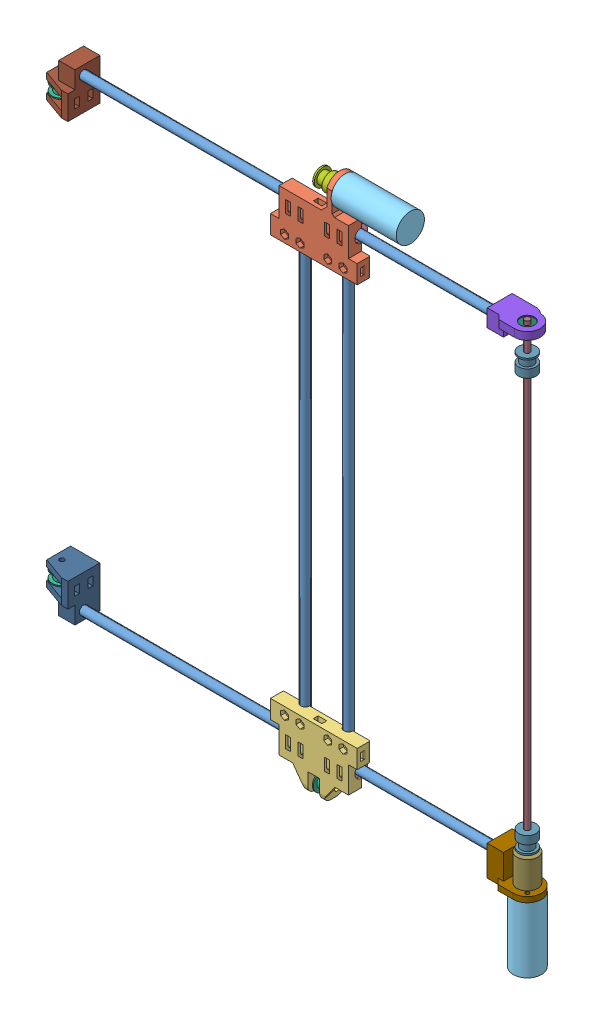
SolidWorks assembly Robot cartesiano.SLDASM, configuration Predeterminado (file format 13000). Lengths in mm.
Overall size (456.38 554.33 36.77).
25 component instances, 15 part files, 58 mates.
Components (placement in the parent):
- Varilla lisa 8x400mm-2: Varilla lisa 8x400mm.SLDPRT [Predeterminado] at (-188.4214 -67.4179 400) x (0 1 0) z (1 0 0) size (8 8 400)
- Varilla lisa 8x400mm-3: Varilla lisa 8x400mm.SLDPRT [Predeterminado] at (-188.4214 -494.7179 400) x (0 1 0) z (1 0 0) size (8 8 400)
- Varilla lisa 8x400mm-4: Varilla lisa 8x400mm.SLDPRT [Predeterminado] at (25.8459 -81.0679 400) x (1 0 0) z (0 -1 0) size (8 8 400)
- Varilla lisa 8x400mm-5: Varilla lisa 8x400mm.SLDPRT [Predeterminado] at (65.6459 -81.0679 400) x (1 0 0) z (0 -1 0) size (8 8 400)
- Carro x A-1: Carro x A.SLDPRT [Predeterminado] at (77.7459 -67.4179 400) x (0 1 0) z (-1 0 0) size (71.3 25 80)
- Carro x B-2: Carro x B.SLDPRT [Predeterminado] at (13.7459 -494.7179 400) x (0 -1 0) z (1 0 0) size (59.3 18 80)
- Lm8uu-1: Lm8uu.SLDPRT [Predeterminado] at (39.8459 -67.4179 400) x (0 0 1) z (-1 0 0) size (15 15 24)
- Lm8uu-2: Lm8uu.SLDPRT [Predeterminado] at (51.7459 -67.4179 400) x (0 0 -1) z (1 0 0) size (15 15 24)
- Lm8uu-3: Lm8uu.SLDPRT [Predeterminado] at (15.7459 -494.7179 400) x (0 0 -1) z (1 0 0) size (15 15 24)
- Lm8uu-4: Lm8uu.SLDPRT [Predeterminado] at (51.7459 -494.7179 400) x (0 0 -1) z (1 0 0) size (15 15 24)
- Motor-1: Motor.SLDPRT [Predeterminado] at (62.7459 -38.7679 400) x (0 -0.707107 -0.707107) z (1 0 0) size (26 26 75)
- Polea gt2 general 12mm B4-1: Polea gt2 general 12mm B4.SLDPRT [Predeterminado] at (49.9959 -520.3679 400) x (0 0 -1) z (-1 0 0) size (18 18 8.5)
- Polea gt2 20t motor eje x-1: Polea gt2 20t motor eje x.SLDPRT [Predeterminado] at (40.7459 -38.7679 400) x (0 0 -1) z (1 0 0) size (16 16 16)
- Fijacion del marco con soporte para balero 625-1: Fijacion del marco con soporte para balero 625.SLDPRT [Predeterminado] at (211.5786 -67.4179 400) x (0 -1 0) z (-1 0 0) size (16 27 41)
- Fijacion del marco con soporte para motor-1: Fijacion del marco con soporte para motor.SLDPRT [Predeterminado] at (211.5786 -494.7179 400) x (0 -1 0) z (-1 0 0) size (28 28 42)
- Motor-2: Motor.SLDPRT [Predeterminado] at (230.5786 -514.7179 400) x (-0.707107 0 -0.707107) z (0 -1 0) size (26 26 75)
- Fijacion del marco con soporte para polea A-1: Fijacion del marco con soporte para polea A.SLDPRT [Predeterminado] at (-188.4214 -494.7179 400) x (0 1 0) z (1 0 0) size (38.15 29.5 27)
- Fijacion del marco con soporte para polea B-1: Fijacion del marco con soporte para polea B.SLDPRT [Predeterminado] at (-198.4214 -67.4179 400) x (0 -1 0) z (-1 0 0) size (38.15 29.5 27)
- Polea gt2 general 12mm B4-2: Polea gt2 general 12mm B4.SLDPRT [Predeterminado] at (-198.4214 -82.3179 400) x (1 0 0) z (0 -1 0) size (18 18 8.5)
- Polea gt2 general 12mm B4-3: Polea gt2 general 12mm B4.SLDPRT [Predeterminado] at (-198.4214 -471.3179 400) x (1 0 0) z (0 -1 0) size (18 18 8.5)
- Cople 4mm a 5mm flexible-1: Cople 4mm a 5mm flexible.SLDPRT [Predeterminado] at (230.5786 -507.7179 400) x (0.999563 0 0.02957) z (0 1 0) size (19 19 25)
- Varilla lisa 5x440mm-1: Varilla lisa 5x440mm.SLDPRT [Predeterminado] at (230.5786 -57.7179 400) x (0.999563 0 0.02957) z (0 -1 0) size (5 5 440)
- Polea gt2 20t motor eje y-1: Polea gt2 20t motor eje y.SLDPRT [Predeterminado] at (230.5786 -480.5679 400) x (0.326284 0 -0.945272) z (0 1 0) size (16 16 16)
- Polea gt2 20t motor eje y-2: Polea gt2 20t motor eje y.SLDPRT [Predeterminado] at (230.5786 -83.5679 400) x (1 0 0) z (0 -1 0) size (16 16 16)
- Balero 625-1: Balero 625.SLDPRT [Predeterminado] at (230.5786 -61.4179 400) x (1 0 0) z (0 -1 0) size (16 16 5)
Mates (geometry in assembly coordinates):
- Concéntrica1: concentric aligned: cylinder of Varilla lisa 8x400mm-3 through (211.5786 -494.7179 400) axis (-1 0 0) radius 4; cylinder of Carro x B-2 through (51.6459 -494.7179 400) axis (-1 0 0) radius 6.15
- Concéntrica2: concentric anti-aligned: cylinder of Varilla lisa 8x400mm-5 through (65.6459 -481.0679 400) axis (0 1 0) radius 4; cylinder of Carro x B-2 through (65.6459 -467.0679 400) axis (0 -1 0) radius 4.1
- Coincidente1: coincident anti-aligned: plane of Varilla lisa 8x400mm-5 through (65.6459 -481.0679 400) normal (0 -1 0); plane of Carro x B-2 through (77.7459 -481.0679 400) normal (0 1 0)
- Concéntrica3: concentric anti-aligned: cylinder of Varilla lisa 8x400mm-4 through (25.8459 -481.0679 400) axis (0 1 0) radius 4; cylinder of Carro x B-2 through (25.8459 -467.0679 400) axis (0 -1 0) radius 4.1
- Coincidente2: coincident anti-aligned: plane of Varilla lisa 8x400mm-4 through (25.8459 -481.0679 400) normal (0 -1 0); plane of Carro x B-2 through (77.7459 -481.0679 400) normal (0 1 0)
- Coincidente3: coincident anti-aligned: plane of Varilla lisa 8x400mm-5 through (65.6459 -81.0679 400) normal (0 1 0); plane of Carro x A-1 through (13.7459 -81.0679 400) normal (0 -1 0)
- Concéntrica4: concentric aligned: cylinder of Varilla lisa 8x400mm-5 through (65.6459 -481.0679 400) axis (0 1 0) radius 4; cylinder of Carro x A-1 through (65.6459 -97.0679 400) axis (0 1 0) radius 4.1
- Concéntrica5: concentric aligned: cylinder of Varilla lisa 8x400mm-4 through (25.8459 -481.0679 400) axis (0 1 0) radius 4; cylinder of Carro x A-1 through (25.8459 -97.0679 400) axis (0 1 0) radius 4.1
- Concéntrica6: concentric anti-aligned: cylinder of Varilla lisa 8x400mm-2 through (211.5786 -67.4179 400) axis (-1 0 0) radius 4; cylinder of Carro x A-1 through (39.8459 -67.4179 400) axis (1 0 0) radius 6.15
- Coincidente4: coincident aligned: plane of Varilla lisa 8x400mm-2 through (211.5786 -67.4179 400) normal (1 0 0); plane of Varilla lisa 8x400mm-3 through (211.5786 -494.7179 400) normal (1 0 0)
- Paralelo1: parallel aligned: plane of Carro x A-1 through (13.7459 -81.0679 412) normal (0 0 1)
- Coincidente5: coincident anti-aligned: plane of Carro x A-1 through (39.8459 -67.4179 400) normal (-1 0 0); plane of Lm8uu-1 through (39.8459 -67.4179 400) normal (1 0 0)
- Concéntrica7: concentric aligned: cylinder of Carro x A-1 through (13.7459 -67.4179 400) axis (1 0 0) radius 7.65; cylinder of Lm8uu-1 through (15.8459 -67.4179 400) axis (1 0 0) radius 7.5
- Coincidente6: coincident aligned: circle of Carro x A-1; plane of Lm8uu-2 through (75.7459 -67.4179 400) normal (1 0 0)
- Concéntrica8: concentric anti-aligned: cylinder of Carro x A-1 through (13.7459 -67.4179 400) axis (1 0 0) radius 7.65; cylinder of Lm8uu-2 through (75.7459 -67.4179 400) axis (-1 0 0) radius 7.5
- Coincidente7: coincident anti-aligned: plane of Carro x B-2 through (15.7459 -494.7179 400) normal (1 0 0); plane of Lm8uu-3 through (15.7459 -494.7179 400) normal (-1 0 0)
- Concéntrica9: concentric aligned: cylinder of Carro x B-2 through (77.7459 -494.7179 400) axis (-1 0 0) radius 7.65; cylinder of Lm8uu-3 through (39.7459 -494.7179 400) axis (-1 0 0) radius 7.5
- Coincidente8: coincident anti-aligned: plane of Carro x B-2 through (75.7459 -494.7179 400) normal (-1 0 0); plane of Lm8uu-4 through (75.7459 -494.7179 400) normal (1 0 0)
- Concéntrica10: concentric aligned: cylinder of Carro x B-2 through (77.7459 -494.7179 400) axis (-1 0 0) radius 7.65; cylinder of Lm8uu-4 through (75.7459 -494.7179 400) axis (-1 0 0) radius 7.5
- Coincidente9: coincident anti-aligned: plane of Carro x A-1 through (62.7459 -38.7679 400) normal (1 0 0); plane of Motor-1 through (62.7459 -38.7679 400) normal (-1 0 0)
- Concéntrica11: concentric anti-aligned: cylinder of Carro x A-1 through (62.7459 -38.7679 400) axis (-1 0 0) radius 3; cylinder of Motor-1 through (47.7459 -38.7679 400) axis (1 0 0) radius 2
- Concéntrica12: concentric anti-aligned: cylinder of Carro x A-1 through (5.7459 -45.1318 393.636) axis (1 0 0) radius 1.65; cylinder of Motor-1 through (69.7459 -45.1318 393.636) axis (-1 0 0) radius 1.5
- Concéntrica13: concentric anti-aligned: cylinder of Carro x B-2 through (55.1459 -520.3679 400) axis (-1 0 0) radius 2.15; cylinder of Polea gt2 general 12mm B4-1 through (42.4959 -520.3679 400) axis (1 0 0) radius 6
- Ancho1: width anti-aligned: plane of Carro x B-2 through (51.1459 -494.7179 400) normal (-1 0 0); plane of Polea gt2 general 12mm B4-1 through (40.3459 -494.7179 400) normal (1 0 0); plane of Carro x B-2 through (49.9959 -520.3679 400) normal (1 0 0); plane of Polea gt2 general 12mm B4-1 through (41.4959 -520.3679 400) normal (-1 0 0)
- Concéntrica14: concentric anti-aligned: cylinder of Motor-1 through (47.7459 -38.7679 400) axis (1 0 0) radius 2; cylinder of Polea gt2 20t motor eje x-1 through (56.7459 -38.7679 400) axis (-1 0 0) radius 8
- Ancho2: width anti-aligned: plane of Carro x A-1 through (49.7459 -97.0679 404) normal (-1 0 0); plane of Polea gt2 20t motor eje x-1 through (41.7459 -97.0679 404) normal (1 0 0); plane of Carro x A-1 through (42.2459 -38.7679 400) normal (1 0 0); plane of Polea gt2 20t motor eje x-1 through (49.2459 -38.7679 400) normal (-1 0 0)
- Relación de posición de correa1: belt = 12 mm: cylinder of Polea gt2 20t motor-1 through (49.2459 -38.7679 400) axis (-1 0 0) radius 5.65; cylinder of Polea gt2 general 12mm B4-1 through (42.4959 -520.3679 400) axis (1 0 0) radius 6
- Paralelo2: parallel anti-aligned: plane of Fijacion del marco con soporte para motor-1 through (201.5786 -514.7179 385) normal (0 0 -1)
- Paralelo3: parallel anti-aligned: plane of Fijacion del marco con soporte para balero 625-1 through (201.5786 -75.4179 385) normal (0 0 -1)
- Concéntrica15: concentric anti-aligned: cylinder of Varilla lisa 8x400mm-3 through (211.5786 -494.7179 400) axis (-1 0 0) radius 4; cylinder of Fijacion del marco con soporte para motor-1 through (201.5786 -494.7179 400) axis (1 0 0) radius 4
- Concéntrica16: concentric anti-aligned: cylinder of Varilla lisa 8x400mm-2 through (211.5786 -67.4179 400) axis (-1 0 0) radius 4; cylinder of Fijacion del marco con soporte para balero 625-1 through (201.5786 -67.4179 400) axis (1 0 0) radius 4
- Coincidente13: coincident anti-aligned: plane of Varilla lisa 8x400mm-3 through (211.5786 -494.7179 400) normal (1 0 0); plane of Fijacion del marco con soporte para motor-1 through (211.5786 -494.7179 400) normal (-1 0 0)
- Coincidente14: coincident anti-aligned: plane of Varilla lisa 8x400mm-2 through (211.5786 -67.4179 400) normal (1 0 0); plane of Fijacion del marco con soporte para balero 625-1 through (211.5786 -67.4179 400) normal (-1 0 0)
- Concéntrica17: concentric aligned: cylinder of Fijacion del marco con soporte para motor-1 through (230.5786 -509.7179 400) axis (0 -1 0) radius 3; cylinder of Motor-2 through (230.5786 -499.7179 400) axis (0 -1 0) radius 2
- Coincidente15: coincident anti-aligned: plane of Fijacion del marco con soporte para motor-1 through (201.5786 -514.7179 408) normal (0 -1 0); plane of Motor-2 through (230.5786 -514.7179 400) normal (0 1 0)
- Concéntrica18: concentric aligned: cylinder of Fijacion del marco con soporte para motor-1 through (224.2146 -514.7179 393.636) axis (0 1 0) radius 1.65; cylinder of Motor-2 through (224.2146 -521.7179 393.636) axis (0 1 0) radius 1.5
- Concéntrica19: concentric aligned: cylinder of Varilla lisa 8x400mm-2 through (211.5786 -67.4179 400) axis (-1 0 0) radius 4; cylinder of Fijacion del marco con soporte para polea B-1 through (-178.4214 -67.4179 400) axis (-1 0 0) radius 4
- Coincidente16: coincident anti-aligned: plane of Varilla lisa 8x400mm-2 through (-188.4214 -67.4179 400) normal (-1 0 0); plane of Fijacion del marco con soporte para polea B-1 through (-188.4214 -67.4179 400) normal (1 0 0)
- Coincidente17: coincident aligned: plane of Fijacion del marco con soporte para balero 625-1 through (201.5786 -75.4179 385) normal (0 0 -1); plane of Fijacion del marco con soporte para polea B-1 through (-178.4214 -75.4179 385) normal (0 0 -1)
- Concéntrica20: concentric aligned: cylinder of Varilla lisa 8x400mm-3 through (211.5786 -494.7179 400) axis (-1 0 0) radius 4; cylinder of Fijacion del marco con soporte para polea A-1 through (-178.4214 -494.7179 400) axis (-1 0 0) radius 4
- Coincidente18: coincident anti-aligned: plane of Varilla lisa 8x400mm-3 through (-188.4214 -494.7179 400) normal (-1 0 0); plane of Fijacion del marco con soporte para polea A-1 through (-188.4214 -494.7179 400) normal (1 0 0)
- Coincidente19: coincident aligned: plane of Fijacion del marco con soporte para motor-1 through (201.5786 -514.7179 385) normal (0 0 -1); plane of Fijacion del marco con soporte para polea A-1 through (-178.4214 -486.7179 385) normal (0 0 -1)
- Concéntrica21: concentric aligned: cylinder of Fijacion del marco con soporte para polea A-1 through (-198.4214 -522.9291 400) axis (0 1 0) radius 2.15; cylinder of Polea gt2 general 12mm B4-3 through (-198.4214 -472.3179 400) axis (0 1 0) radius 2
- Concéntrica22: concentric anti-aligned: cylinder of Fijacion del marco con soporte para polea B-1 through (-198.4214 -91.9679 400) axis (0 -1 0) radius 2.15; cylinder of Polea gt2 general 12mm B4-2 through (-198.4214 -83.3179 400) axis (0 1 0) radius 2
- Ancho3: width anti-aligned: plane of Fijacion del marco con soporte para polea B-1 through (-188.4214 -81.1679 400) normal (0 -1 0); plane of Polea gt2 general 12mm B4-2 through (-188.4214 -91.9679 400) normal (0 1 0); plane of Fijacion del marco con soporte para polea B-1 through (-198.4214 -82.3179 400) normal (0 1 0); plane of Polea gt2 general 12mm B4-2 through (-198.4214 -90.8179 400) normal (0 -1 0)
- Ancho4: width anti-aligned: plane of Fijacion del marco con soporte para polea A-1 through (-188.4214 -470.1679 400) normal (0 -1 0); plane of Polea gt2 general 12mm B4-3 through (-188.4214 -480.9679 400) normal (0 1 0); plane of Fijacion del marco con soporte para polea A-1 through (-198.4214 -471.3179 400) normal (0 1 0); plane of Polea gt2 general 12mm B4-3 through (-198.4214 -479.8179 400) normal (0 -1 0)
- Concéntrica23: concentric aligned: cylinder of Fijacion del marco con soporte para balero 625-1 through (230.5786 -66.4179 400) axis (0 1 0) radius 8; cylinder of Balero 625-1 through (230.5786 -66.4179 400) axis (0 1 0) radius 8
- Coincidente20: coincident aligned: plane of Fijacion del marco con soporte para balero 625-1 through (230.5786 -66.4179 400) normal (0 -1 0); plane of Balero 625-1 through (230.5786 -66.4179 400) normal (0 -1 0)
- Concéntrica25: concentric aligned: cylinder of Motor-2 through (230.5786 -499.7179 400) axis (0 -1 0) radius 2; cylinder of Cople 4mm a 5mm flexible-1 through (230.5786 -482.7179 400) axis (0 -1 0) radius 2
- Distancia1: distance = 8 mm anti-aligned: plane of Cople 4mm a 5mm flexible-1 through (230.5786 -507.7179 400) normal (0 -1 0); plane of Motor-2 through (230.5786 -499.7179 400) normal (0 1 0)
- Concéntrica27: concentric anti-aligned: cylinder of Cople 4mm a 5mm flexible-1 through (230.5786 -482.7179 400) axis (0 -1 0) radius 9.5; cylinder of Varilla lisa 5x440mm-1 through (230.5786 -497.7179 400) axis (0 1 0) radius 2.5
- Coincidente22: coincident anti-aligned: plane of Cople 4mm a 5mm flexible-1 through (230.5786 -497.7179 400) normal (0 1 0); plane of Varilla lisa 5x440mm-1 through (230.5786 -497.7179 400) normal (0 -1 0)
- Concéntrica28: concentric anti-aligned: cylinder of Varilla lisa 5x440mm-1 through (230.5786 -497.7179 400) axis (0 1 0) radius 2.5; cylinder of Polea gt2 20t motor eje y-1 through (230.5786 -464.5679 400) axis (0 -1 0) radius 8
- Concéntrica30: concentric aligned: cylinder of Varilla lisa 5x440mm-1 through (230.5786 -497.7179 400) axis (0 1 0) radius 2.5; cylinder of Polea gt2 20t motor eje y-2 through (230.5786 -99.5679 400) axis (0 1 0) radius 8
- Ancho5: width anti-aligned: plane of Polea gt2 20t motor eje y-1 through (230.5786 -472.0679 400) normal (0 -1 0); plane of Carro x B-2 through (230.5786 -479.0679 400) normal (0 1 0); plane of Polea gt2 20t motor eje y-1 through (13.7459 -479.0679 400) normal (0 1 0); plane of Carro x B-2 through (13.7459 -472.0679 400) normal (0 -1 0)
- Ancho6: width anti-aligned: plane of Polea gt2 20t motor eje y-2 through (230.5786 -85.0679 400) normal (0 -1 0); plane of Carro x A-1 through (230.5786 -92.0679 400) normal (0 1 0); plane of Polea gt2 20t motor eje y-2 through (13.7459 -92.0679 400) normal (0 1 0); plane of Carro x A-1 through (13.7459 -85.0679 400) normal (0 -1 0)
- Relación de posición de correa2: belt = 12 mm: cylinder of Polea gt2 20t motor eje y-1 through (230.5786 -472.0679 400) axis (0 -1 0) radius 5.65; cylinder of Polea gt2 general 12mm B4-3 through (-198.4214 -478.8179 400) axis (0 1 0) radius 6
- Relación de posición de correa3: belt = 12 mm: cylinder of Polea gt2 20t motor eje y-2 through (230.5786 -92.0679 400) axis (0 1 0) radius 5.65; cylinder of Polea gt2 general 12mm B4-2 through (-198.4214 -89.8179 400) axis (0 1 0) radius 6
